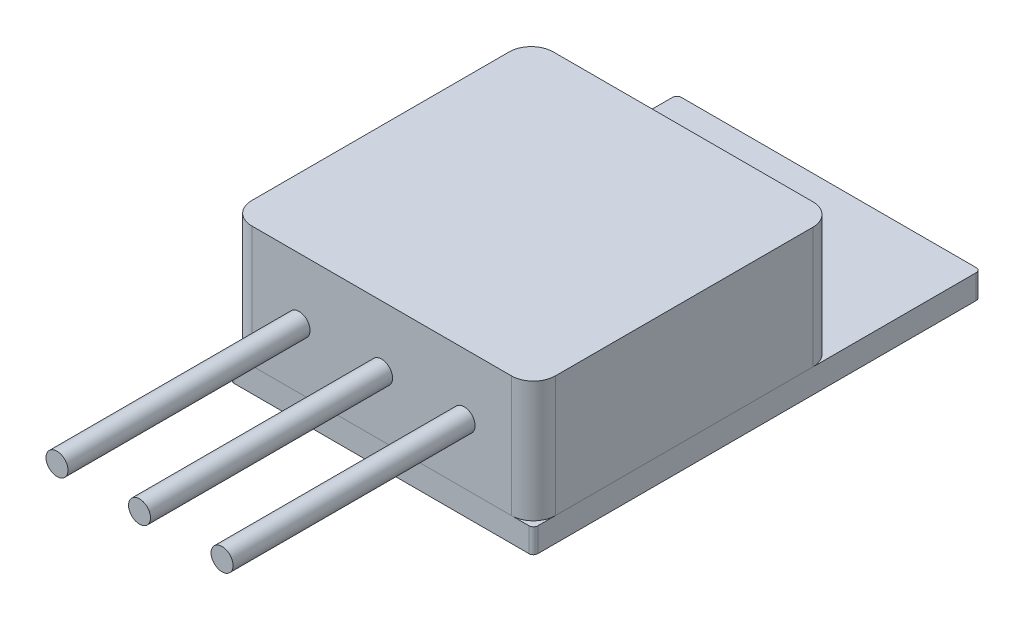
from build123d import *

# Parameters (mm, degrees)
EXTRUDE_1_DEPTH        = 1.1
EXTRUDE_2_DEPTH        = 5.5
SKETCH_7_W             = 1.825
SKETCH_7_H             = 1.1
SKETCH_5_3_R           = 0.5
STRAIGHT_DEPTH         = 11
PATTERN_LINEAR_1_COUNT = 2
PATTERN_LINEAR_1_PITCH = 3.75
PATTERN_LINEAR_2_COUNT = 2
PATTERN_LINEAR_2_PITCH = 3.75


with BuildPart() as part:
    # Sketch 1 → Extrude 1 (new body)
    with BuildSketch(Plane(origin=(0, 0, 0), x_dir=(1, 0, 0), z_dir=(0, 1, 0))):
        with BuildLine():
            Line((6.9, 0.2), (6.9, 20.12))
            ThreePointArc((6.9, 20.12), (6.841421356, 20.261421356), (6.7, 20.32))
            Line((6.7, 20.32), (-6.7, 20.32))
            ThreePointArc((-6.7, 20.32), (-6.841421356, 20.261421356), (-6.9, 20.12))
            Line((-6.9, 20.12), (-6.9, 0.2))
            ThreePointArc((-6.9, 0.2), (-6.841421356, 0.058578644), (-6.7, 0))
            Line((-6.7, 0), (6.7, 0))
            ThreePointArc((6.7, 0), (6.841421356, 0.058578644), (6.9, 0.2))
        make_face()
    extrude(amount=EXTRUDE_1_DEPTH)

    # Sketch 7 → M3 Clearance Hole1 (revolve, cut)
    with BuildSketch(Plane(origin=(0, 1.1, -17.2), x_dir=(0, 0, 1), z_dir=(1, 0, 0))):
        with Locations((0.9125, 0.55)):
            Rectangle(SKETCH_7_W, SKETCH_7_H)
    revolve(axis=Axis((0, 7.45, -17.2), (0, -1, 0)), mode=Mode.SUBTRACT)


with BuildPart() as body_2:
    # Sketch 2 → Extrude 2 (new body)
    with BuildSketch(Plane(origin=(0, 1.1, 0), x_dir=(-1, 0, 0), z_dir=(0, 1, 0))):
        with BuildLine():
            Line((6.9, -1), (6.9, -12.7))
            ThreePointArc((6.9, -12.7), (6.607106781, -13.407106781), (5.9, -13.7))
            Line((5.9, -13.7), (-5.9, -13.7))
            ThreePointArc((-5.9, -13.7), (-6.607106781, -13.407106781), (-6.9, -12.7))
            Line((-6.9, -12.7), (-6.9, -1))
            ThreePointArc((-6.9, -1), (-6.607106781, -0.292893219), (-5.9, 0))
            Line((-5.9, 0), (5.9, 0))
            ThreePointArc((5.9, 0), (6.607106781, -0.292893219), (6.9, -1))
        make_face()
    extrude(amount=EXTRUDE_2_DEPTH)


with BuildPart() as body_3:
    # Sketch 5_3 → Straight (new body)
    with BuildSketch(Plane.XY):
        with Locations((0, 3.81)):
            Circle(SKETCH_5_3_R)
    straight = extrude(amount=STRAIGHT_DEPTH)


with BuildPart() as body_2_1:
    add(body_2.part)

    # Pattern Linear 1: Straight ×2
    with Locations(*[(-i * PATTERN_LINEAR_1_PITCH, 0, 0) for i in range(1, PATTERN_LINEAR_1_COUNT)]):
        add(straight)

    # Pattern Linear 2: Straight ×2
    with Locations(*[(i * PATTERN_LINEAR_2_PITCH, 0, 0) for i in range(1, PATTERN_LINEAR_2_COUNT)]):
        add(straight)


solid = Compound([part.part, body_3.part, body_2_1.part])
